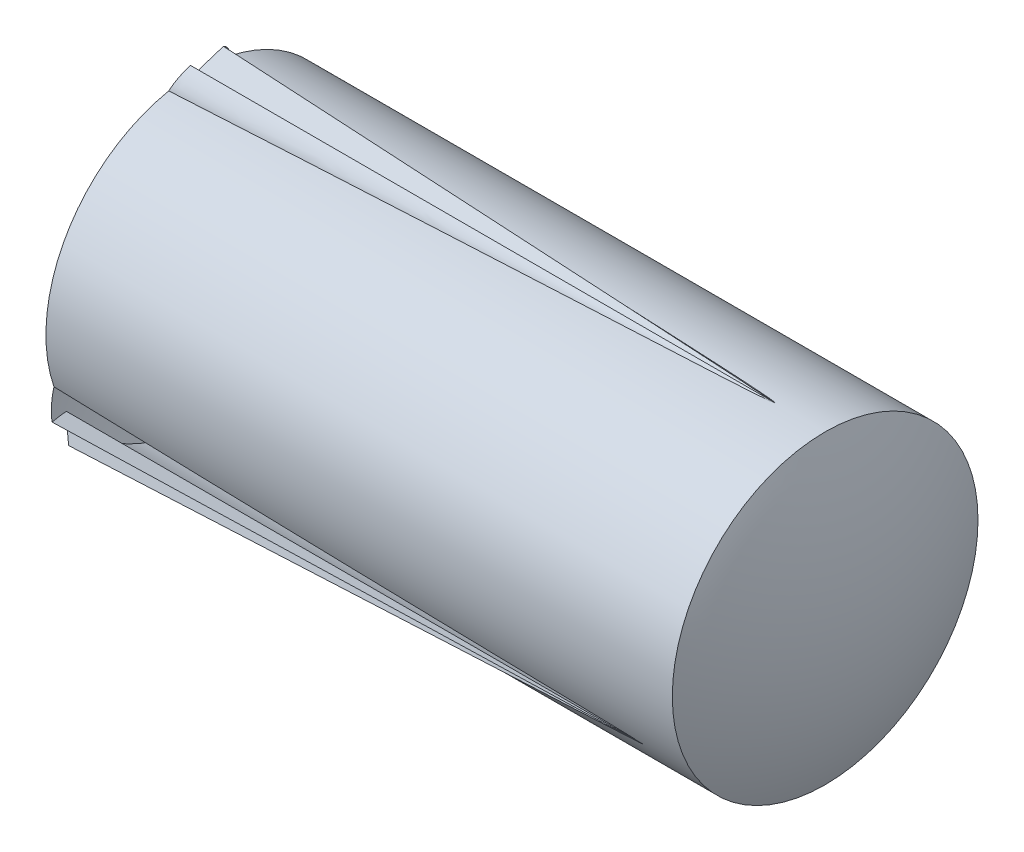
from build123d import *
from build123d.topology import SkipClean

# Parameters (mm, degrees)
GROOVEPROFILE_R    = 0.15494
GROOVEPOINT_R      = 0.015062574
CUT_EXTRUDE1_DEPTH = 4.54105118
CIRPATTERN1_COUNT  = 3


with BuildPart() as part:
    # BaseSke → Revolve1 (revolve)
    with BuildSketch(Plane.XY):
        with BuildLine():
            Line((-1.7526, 0), (1.7526, 0))
            ThreePointArc((1.7526, 0), (1.710866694, 0.39604864), (1.5875, 0.7747))
            Line((1.5875, 0.7747), (-1.5875, 0.7747))
            ThreePointArc((-1.5875, 0.7747), (-1.710866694, 0.39604864), (-1.7526, 0))
        make_face()
    revolve(axis=Axis((-1.7526, 0, 0), (-1, 0, 0)))

    # GrooveProfile → Groove section 0
    with BuildSketch(Plane(origin=(-1.5875, 0, 0), x_dir=(0, 0, -1), z_dir=(1, 0, 0))):
        with Locations((0, 0.729715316)):
            Circle(GROOVEPROFILE_R)
    # GroovePoint → Groove section 1
    with BuildSketch(Plane(origin=(1.3335, 0, 0), x_dir=(0, 0, -1), z_dir=(1, 0, 0))):
        with Locations((0, 0.759637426)):
            Circle(GROOVEPOINT_R)
    groove = loft()

    # Sketch7 → Cut-Extrude1 (cut, through all)
    with BuildSketch(Plane(origin=(-1.5875, 0, 0), x_dir=(0, 0, -1), z_dir=(1, 0, 0))):
        Polygon((0, 0.7747), (0.084733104, 0.859433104), (0, 0.944166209), (-0.084733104, 0.859433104), align=None)
    cut_extrude1 = extrude(amount=CUT_EXTRUDE1_DEPTH, mode=Mode.SUBTRACT)

    # CirPattern1: Groove, Cut-Extrude1 ×3 about axis
    cirpattern1_axis = Axis((-1.7526, 0, 0), (1, 0, 0))
    add([groove.rotate(cirpattern1_axis, i * 360 / CIRPATTERN1_COUNT) for i in range(1, CIRPATTERN1_COUNT)])
    add([cut_extrude1.rotate(cirpattern1_axis, i * 360 / CIRPATTERN1_COUNT) for i in range(1, CIRPATTERN1_COUNT)], mode=Mode.SUBTRACT)

    # Sketch6 → Cut-Revolve1 (revolve, cut)
    with SkipClean():  # the faces are left unmerged after this step: merging them gives an invalid solid
        with BuildSketch(Plane.XY, mode=Mode.PRIVATE) as cut_revolve1_sk:
            with BuildLine():
                Line((-1.545007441, 0.8636), (-5.2578, 0.8636))
                Line((-5.2578, 0.8636), (-5.2578, 0))
                Line((-5.2578, 0), (-1.7526, 0))
                ThreePointArc((-1.7526, 0), (-1.699973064, 0.44410011), (-1.545007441, 0.8636))
            make_face()
        revolve(cut_revolve1_sk.sketch.rotate(Axis((-5.2578, 0, 0), (1, 0, 0)), 180), axis=Axis((-5.2578, 0, 0), (1, 0, 0)), mode=Mode.SUBTRACT)


solid = part.part
